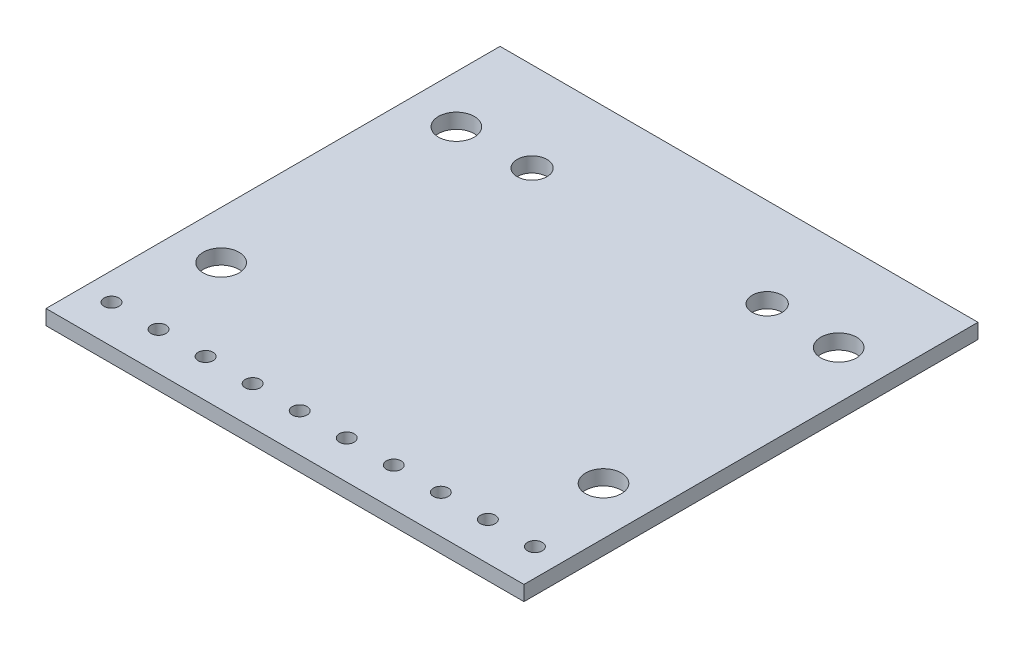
ISO-10303-21;
HEADER;
FILE_DESCRIPTION(('STEP AP214'),'2;1');
FILE_NAME('part.step','',(''),(''),'','','');
FILE_SCHEMA(('AUTOMOTIVE_DESIGN { 1 0 10303 214 1 1 1 1 }'));
ENDSEC;
DATA;
#1=APPLICATION_CONTEXT('core data for automotive mechanical design processes');
#2=APPLICATION_PROTOCOL_DEFINITION('international standard','automotive_design',2000,#1);
#3=PRODUCT_CONTEXT('',#1,'mechanical');
#4=PRODUCT('Part','Part','',(#3));
#5=PRODUCT_RELATED_PRODUCT_CATEGORY('part','',(#4));
#6=PRODUCT_DEFINITION_FORMATION('','',#4);
#7=PRODUCT_DEFINITION_CONTEXT('part definition',#1,'design');
#8=PRODUCT_DEFINITION('design','',#6,#7);
#9=PRODUCT_DEFINITION_SHAPE('','',#8);
#10=(LENGTH_UNIT() NAMED_UNIT(*) SI_UNIT(.MILLI.,.METRE.));
#11=(NAMED_UNIT(*) PLANE_ANGLE_UNIT() SI_UNIT($,.RADIAN.));
#12=(NAMED_UNIT(*) SI_UNIT($,.STERADIAN.) SOLID_ANGLE_UNIT());
#13=UNCERTAINTY_MEASURE_WITH_UNIT(LENGTH_MEASURE(1.E-05),#10,'distance_accuracy_value','');
#14=(GEOMETRIC_REPRESENTATION_CONTEXT(3) GLOBAL_UNCERTAINTY_ASSIGNED_CONTEXT((#13)) GLOBAL_UNIT_ASSIGNED_CONTEXT((#10,
#11,#12)) REPRESENTATION_CONTEXT('',''));
#15=CARTESIAN_POINT('',(0.,0.,0.));
#16=DIRECTION('',(0.,0.,1.));
#17=DIRECTION('',(1.,0.,0.));
#18=AXIS2_PLACEMENT_3D('',#15,#16,#17);
#19=CARTESIAN_POINT('',(0.,-1.5875,0.));
#20=DIRECTION('',(-1.,0.,0.));
#21=DIRECTION('',(0.,0.,1.));
#22=AXIS2_PLACEMENT_3D('',#19,#20,#21);
#23=PLANE('',#22);
#24=DIRECTION('',(0.,0.,1.));
#25=VECTOR('',#24,1.);
#26=CARTESIAN_POINT('',(0.,0.,0.));
#27=LINE('',#26,#25);
#28=CARTESIAN_POINT('',(0.,0.,-48.26));
#29=VERTEX_POINT('',#28);
#30=CARTESIAN_POINT('',(0.,0.,0.));
#31=VERTEX_POINT('',#30);
#32=EDGE_CURVE('E97',#29,#31,#27,.T.);
#33=ORIENTED_EDGE('',*,*,#32,.F.);
#34=DIRECTION('',(0.,1.,0.));
#35=VECTOR('',#34,1.);
#36=CARTESIAN_POINT('',(0.,-1.5875,-48.26));
#37=LINE('',#36,#35);
#38=CARTESIAN_POINT('',(0.,-1.5875,-48.26));
#39=VERTEX_POINT('',#38);
#40=EDGE_CURVE('E11',#39,#29,#37,.T.);
#41=ORIENTED_EDGE('',*,*,#40,.F.);
#42=DIRECTION('',(0.,0.,1.));
#43=VECTOR('',#42,1.);
#44=CARTESIAN_POINT('',(0.,-1.5875,0.));
#45=LINE('',#44,#43);
#46=CARTESIAN_POINT('',(0.,-1.5875,0.));
#47=VERTEX_POINT('',#46);
#48=EDGE_CURVE('E90',#39,#47,#45,.T.);
#49=ORIENTED_EDGE('',*,*,#48,.T.);
#50=DIRECTION('',(0.,1.,0.));
#51=VECTOR('',#50,1.);
#52=CARTESIAN_POINT('',(0.,-1.5875,0.));
#53=LINE('',#52,#51);
#54=EDGE_CURVE('E35',#47,#31,#53,.T.);
#55=ORIENTED_EDGE('',*,*,#54,.T.);
#56=EDGE_LOOP('',(#33,#41,#49,#55));
#57=FACE_BOUND('',#56,.T.);
#58=ADVANCED_FACE('F32',(#57),#23,.T.);
#59=CARTESIAN_POINT('',(0.,-1.5875,-48.26));
#60=DIRECTION('',(0.,0.,-1.));
#61=DIRECTION('',(-1.,0.,0.));
#62=AXIS2_PLACEMENT_3D('',#59,#60,#61);
#63=PLANE('',#62);
#64=DIRECTION('',(-1.,0.,0.));
#65=VECTOR('',#64,1.);
#66=CARTESIAN_POINT('',(0.,0.,-48.26));
#67=LINE('',#66,#65);
#68=CARTESIAN_POINT('',(50.8,0.,-48.26));
#69=VERTEX_POINT('',#68);
#70=EDGE_CURVE('E92',#69,#29,#67,.T.);
#71=ORIENTED_EDGE('',*,*,#70,.F.);
#72=DIRECTION('',(0.,1.,0.));
#73=VECTOR('',#72,1.);
#74=CARTESIAN_POINT('',(50.8,-1.5875,-48.26));
#75=LINE('',#74,#73);
#76=CARTESIAN_POINT('',(50.8,-1.5875,-48.26));
#77=VERTEX_POINT('',#76);
#78=EDGE_CURVE('E41',#77,#69,#75,.T.);
#79=ORIENTED_EDGE('',*,*,#78,.F.);
#80=DIRECTION('',(-1.,0.,0.));
#81=VECTOR('',#80,1.);
#82=CARTESIAN_POINT('',(0.,-1.5875,-48.26));
#83=LINE('',#82,#81);
#84=EDGE_CURVE('E87',#77,#39,#83,.T.);
#85=ORIENTED_EDGE('',*,*,#84,.T.);
#86=ORIENTED_EDGE('',*,*,#40,.T.);
#87=EDGE_LOOP('',(#71,#79,#85,#86));
#88=FACE_BOUND('',#87,.T.);
#89=ADVANCED_FACE('F108',(#88),#63,.T.);
#90=CARTESIAN_POINT('',(50.8,-1.5875,0.));
#91=DIRECTION('',(1.,0.,0.));
#92=DIRECTION('',(0.,0.,-1.));
#93=AXIS2_PLACEMENT_3D('',#90,#91,#92);
#94=PLANE('',#93);
#95=DIRECTION('',(0.,0.,-1.));
#96=VECTOR('',#95,1.);
#97=CARTESIAN_POINT('',(50.8,0.,0.));
#98=LINE('',#97,#96);
#99=CARTESIAN_POINT('',(50.8,0.,0.));
#100=VERTEX_POINT('',#99);
#101=EDGE_CURVE('E82',#100,#69,#98,.T.);
#102=ORIENTED_EDGE('',*,*,#101,.F.);
#103=DIRECTION('',(0.,1.,0.));
#104=VECTOR('',#103,1.);
#105=CARTESIAN_POINT('',(50.8,-1.5875,0.));
#106=LINE('',#105,#104);
#107=CARTESIAN_POINT('',(50.8,-1.5875,0.));
#108=VERTEX_POINT('',#107);
#109=EDGE_CURVE('E77',#108,#100,#106,.T.);
#110=ORIENTED_EDGE('',*,*,#109,.F.);
#111=DIRECTION('',(0.,0.,-1.));
#112=VECTOR('',#111,1.);
#113=CARTESIAN_POINT('',(50.8,-1.5875,0.));
#114=LINE('',#113,#112);
#115=EDGE_CURVE('E80',#108,#77,#114,.T.);
#116=ORIENTED_EDGE('',*,*,#115,.T.);
#117=ORIENTED_EDGE('',*,*,#78,.T.);
#118=EDGE_LOOP('',(#102,#110,#116,#117));
#119=FACE_BOUND('',#118,.T.);
#120=ADVANCED_FACE('F79',(#119),#94,.T.);
#121=CARTESIAN_POINT('',(0.,-1.5875,0.));
#122=DIRECTION('',(0.,0.,1.));
#123=DIRECTION('',(1.,0.,0.));
#124=AXIS2_PLACEMENT_3D('',#121,#122,#123);
#125=PLANE('',#124);
#126=DIRECTION('',(1.,0.,0.));
#127=VECTOR('',#126,1.);
#128=CARTESIAN_POINT('',(0.,0.,0.));
#129=LINE('',#128,#127);
#130=EDGE_CURVE('E100',#31,#100,#129,.T.);
#131=ORIENTED_EDGE('',*,*,#130,.F.);
#132=ORIENTED_EDGE('',*,*,#54,.F.);
#133=DIRECTION('',(1.,0.,0.));
#134=VECTOR('',#133,1.);
#135=CARTESIAN_POINT('',(0.,-1.5875,0.));
#136=LINE('',#135,#134);
#137=EDGE_CURVE('E86',#47,#108,#136,.T.);
#138=ORIENTED_EDGE('',*,*,#137,.T.);
#139=ORIENTED_EDGE('',*,*,#109,.T.);
#140=EDGE_LOOP('',(#131,#132,#138,#139));
#141=FACE_BOUND('',#140,.T.);
#142=ADVANCED_FACE('F89',(#141),#125,.T.);
#143=CARTESIAN_POINT('',(0.,-1.5875,0.));
#144=DIRECTION('',(0.,-1.,0.));
#145=DIRECTION('',(0.,0.,-1.));
#146=AXIS2_PLACEMENT_3D('',#143,#144,#145);
#147=PLANE('',#146);
#148=CARTESIAN_POINT('',(37.895,-1.5875,-38.76));
#149=DIRECTION('',(0.,1.,0.));
#150=DIRECTION('',(0.,0.,-1.));
#151=AXIS2_PLACEMENT_3D('',#148,#149,#150);
#152=CIRCLE('',#151,1.59);
#153=CARTESIAN_POINT('',(37.895,-1.5875,-40.35));
#154=VERTEX_POINT('',#153);
#155=EDGE_CURVE('E197',#154,#154,#152,.T.);
#156=ORIENTED_EDGE('',*,*,#155,.T.);
#157=EDGE_LOOP('',(#156));
#158=FACE_BOUND('',#157,.T.);
#159=CARTESIAN_POINT('',(12.905,-1.5875,-38.76));
#160=DIRECTION('',(0.,1.,0.));
#161=DIRECTION('',(0.,0.,1.));
#162=AXIS2_PLACEMENT_3D('',#159,#160,#161);
#163=CIRCLE('',#162,1.59);
#164=CARTESIAN_POINT('',(12.905,-1.5875,-37.17));
#165=VERTEX_POINT('',#164);
#166=EDGE_CURVE('E205',#165,#165,#163,.T.);
#167=ORIENTED_EDGE('',*,*,#166,.T.);
#168=EDGE_LOOP('',(#167));
#169=FACE_BOUND('',#168,.T.);
#170=CARTESIAN_POINT('',(47.9,-1.5875,-4.064));
#171=DIRECTION('',(0.,1.,0.));
#172=DIRECTION('',(0.,0.,1.));
#173=AXIS2_PLACEMENT_3D('',#170,#171,#172);
#174=CIRCLE('',#173,0.787400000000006);
#175=CARTESIAN_POINT('',(47.9,-1.5875,-3.27659999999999));
#176=VERTEX_POINT('',#175);
#177=EDGE_CURVE('E211',#176,#176,#174,.T.);
#178=ORIENTED_EDGE('',*,*,#177,.T.);
#179=EDGE_LOOP('',(#178));
#180=FACE_BOUND('',#179,.T.);
#181=CARTESIAN_POINT('',(37.9,-1.5875,-4.064));
#182=DIRECTION('',(0.,1.,0.));
#183=DIRECTION('',(0.,0.,1.));
#184=AXIS2_PLACEMENT_3D('',#181,#182,#183);
#185=CIRCLE('',#184,0.787399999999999);
#186=CARTESIAN_POINT('',(37.9,-1.5875,-3.2766));
#187=VERTEX_POINT('',#186);
#188=EDGE_CURVE('E217',#187,#187,#185,.T.);
#189=ORIENTED_EDGE('',*,*,#188,.T.);
#190=EDGE_LOOP('',(#189));
#191=FACE_BOUND('',#190,.T.);
#192=CARTESIAN_POINT('',(32.9,-1.5875,-4.064));
#193=DIRECTION('',(0.,1.,0.));
#194=DIRECTION('',(0.,0.,1.));
#195=AXIS2_PLACEMENT_3D('',#192,#193,#194);
#196=CIRCLE('',#195,0.787399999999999);
#197=CARTESIAN_POINT('',(32.9,-1.5875,-3.2766));
#198=VERTEX_POINT('',#197);
#199=EDGE_CURVE('E223',#198,#198,#196,.T.);
#200=ORIENTED_EDGE('',*,*,#199,.T.);
#201=EDGE_LOOP('',(#200));
#202=FACE_BOUND('',#201,.T.);
#203=CARTESIAN_POINT('',(27.9,-1.5875,-4.064));
#204=DIRECTION('',(0.,1.,0.));
#205=DIRECTION('',(0.,0.,1.));
#206=AXIS2_PLACEMENT_3D('',#203,#204,#205);
#207=CIRCLE('',#206,0.787400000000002);
#208=CARTESIAN_POINT('',(27.9,-1.5875,-3.2766));
#209=VERTEX_POINT('',#208);
#210=EDGE_CURVE('E229',#209,#209,#207,.T.);
#211=ORIENTED_EDGE('',*,*,#210,.T.);
#212=EDGE_LOOP('',(#211));
#213=FACE_BOUND('',#212,.T.);
#214=CARTESIAN_POINT('',(22.9,-1.5875,-4.064));
#215=DIRECTION('',(0.,1.,0.));
#216=DIRECTION('',(0.,0.,1.));
#217=AXIS2_PLACEMENT_3D('',#214,#215,#216);
#218=CIRCLE('',#217,0.787400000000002);
#219=CARTESIAN_POINT('',(22.9,-1.5875,-3.2766));
#220=VERTEX_POINT('',#219);
#221=EDGE_CURVE('E235',#220,#220,#218,.T.);
#222=ORIENTED_EDGE('',*,*,#221,.T.);
#223=EDGE_LOOP('',(#222));
#224=FACE_BOUND('',#223,.T.);
#225=CARTESIAN_POINT('',(17.9,-1.5875,-4.064));
#226=DIRECTION('',(0.,1.,0.));
#227=DIRECTION('',(0.,0.,1.));
#228=AXIS2_PLACEMENT_3D('',#225,#226,#227);
#229=CIRCLE('',#228,0.787400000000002);
#230=CARTESIAN_POINT('',(17.9,-1.5875,-3.2766));
#231=VERTEX_POINT('',#230);
#232=EDGE_CURVE('E241',#231,#231,#229,.T.);
#233=ORIENTED_EDGE('',*,*,#232,.T.);
#234=EDGE_LOOP('',(#233));
#235=FACE_BOUND('',#234,.T.);
#236=CARTESIAN_POINT('',(12.9,-1.5875,-4.064));
#237=DIRECTION('',(0.,1.,0.));
#238=DIRECTION('',(0.,0.,1.));
#239=AXIS2_PLACEMENT_3D('',#236,#237,#238);
#240=CIRCLE('',#239,0.787400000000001);
#241=CARTESIAN_POINT('',(12.9,-1.5875,-3.2766));
#242=VERTEX_POINT('',#241);
#243=EDGE_CURVE('E247',#242,#242,#240,.T.);
#244=ORIENTED_EDGE('',*,*,#243,.T.);
#245=EDGE_LOOP('',(#244));
#246=FACE_BOUND('',#245,.T.);
#247=CARTESIAN_POINT('',(7.9,-1.5875,-4.064));
#248=DIRECTION('',(0.,1.,0.));
#249=DIRECTION('',(0.,0.,1.));
#250=AXIS2_PLACEMENT_3D('',#247,#248,#249);
#251=CIRCLE('',#250,0.787400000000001);
#252=CARTESIAN_POINT('',(7.9,-1.5875,-3.2766));
#253=VERTEX_POINT('',#252);
#254=EDGE_CURVE('E253',#253,#253,#251,.T.);
#255=ORIENTED_EDGE('',*,*,#254,.T.);
#256=EDGE_LOOP('',(#255));
#257=FACE_BOUND('',#256,.T.);
#258=CARTESIAN_POINT('',(42.9,-1.5875,-4.064));
#259=DIRECTION('',(0.,1.,0.));
#260=DIRECTION('',(0.,0.,1.));
#261=AXIS2_PLACEMENT_3D('',#258,#259,#260);
#262=CIRCLE('',#261,0.787399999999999);
#263=CARTESIAN_POINT('',(42.9,-1.5875,-3.2766));
#264=VERTEX_POINT('',#263);
#265=EDGE_CURVE('E259',#264,#264,#262,.T.);
#266=ORIENTED_EDGE('',*,*,#265,.T.);
#267=EDGE_LOOP('',(#266));
#268=FACE_BOUND('',#267,.T.);
#269=CARTESIAN_POINT('',(2.9,-1.5875,-4.064));
#270=DIRECTION('',(0.,1.,0.));
#271=DIRECTION('',(0.,0.,1.));
#272=AXIS2_PLACEMENT_3D('',#269,#270,#271);
#273=CIRCLE('',#272,0.7874);
#274=CARTESIAN_POINT('',(2.9,-1.5875,-3.2766));
#275=VERTEX_POINT('',#274);
#276=EDGE_CURVE('E265',#275,#275,#273,.T.);
#277=ORIENTED_EDGE('',*,*,#276,.T.);
#278=EDGE_LOOP('',(#277));
#279=FACE_BOUND('',#278,.T.);
#280=CARTESIAN_POINT('',(45.72,-1.5875,-38.535));
#281=DIRECTION('',(0.,1.,0.));
#282=DIRECTION('',(0.,0.,-1.));
#283=AXIS2_PLACEMENT_3D('',#280,#281,#282);
#284=CIRCLE('',#283,1.905);
#285=CARTESIAN_POINT('',(45.72,-1.5875,-40.44));
#286=VERTEX_POINT('',#285);
#287=EDGE_CURVE('E271',#286,#286,#284,.T.);
#288=ORIENTED_EDGE('',*,*,#287,.T.);
#289=EDGE_LOOP('',(#288));
#290=FACE_BOUND('',#289,.T.);
#291=CARTESIAN_POINT('',(45.72,-1.5875,-13.535));
#292=DIRECTION('',(0.,1.,0.));
#293=DIRECTION('',(0.,0.,-1.));
#294=AXIS2_PLACEMENT_3D('',#291,#292,#293);
#295=CIRCLE('',#294,1.90499999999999);
#296=CARTESIAN_POINT('',(45.72,-1.5875,-15.44));
#297=VERTEX_POINT('',#296);
#298=EDGE_CURVE('E277',#297,#297,#295,.T.);
#299=ORIENTED_EDGE('',*,*,#298,.T.);
#300=EDGE_LOOP('',(#299));
#301=FACE_BOUND('',#300,.T.);
#302=CARTESIAN_POINT('',(5.08,-1.5875,-38.535));
#303=DIRECTION('',(0.,1.,0.));
#304=DIRECTION('',(0.,0.,1.));
#305=AXIS2_PLACEMENT_3D('',#302,#303,#304);
#306=CIRCLE('',#305,1.905);
#307=CARTESIAN_POINT('',(5.08,-1.5875,-36.63));
#308=VERTEX_POINT('',#307);
#309=EDGE_CURVE('E283',#308,#308,#306,.T.);
#310=ORIENTED_EDGE('',*,*,#309,.T.);
#311=EDGE_LOOP('',(#310));
#312=FACE_BOUND('',#311,.T.);
#313=CARTESIAN_POINT('',(5.08,-1.5875,-13.535));
#314=DIRECTION('',(0.,1.,0.));
#315=DIRECTION('',(0.,0.,1.));
#316=AXIS2_PLACEMENT_3D('',#313,#314,#315);
#317=CIRCLE('',#316,1.905);
#318=CARTESIAN_POINT('',(5.08,-1.5875,-11.63));
#319=VERTEX_POINT('',#318);
#320=EDGE_CURVE('E101',#319,#319,#317,.T.);
#321=ORIENTED_EDGE('',*,*,#320,.T.);
#322=EDGE_LOOP('',(#321));
#323=FACE_BOUND('',#322,.T.);
#324=ORIENTED_EDGE('',*,*,#48,.F.);
#325=ORIENTED_EDGE('',*,*,#84,.F.);
#326=ORIENTED_EDGE('',*,*,#115,.F.);
#327=ORIENTED_EDGE('',*,*,#137,.F.);
#328=EDGE_LOOP('',(#324,#325,#326,#327));
#329=FACE_BOUND('',#328,.T.);
#330=ADVANCED_FACE('F85',(#158,#169,#180,#191,#202,#213,#224,#235,#246,#257,#268,#279,#290,#301,
#312,#323,#329),#147,.T.);
#331=CARTESIAN_POINT('',(0.,0.,0.));
#332=DIRECTION('',(0.,-1.,0.));
#333=DIRECTION('',(0.,0.,-1.));
#334=AXIS2_PLACEMENT_3D('',#331,#332,#333);
#335=PLANE('',#334);
#336=CARTESIAN_POINT('',(37.895,0.,-38.76));
#337=DIRECTION('',(0.,1.,0.));
#338=DIRECTION('',(0.,0.,-1.));
#339=AXIS2_PLACEMENT_3D('',#336,#337,#338);
#340=CIRCLE('',#339,1.59);
#341=CARTESIAN_POINT('',(37.895,0.,-40.35));
#342=VERTEX_POINT('',#341);
#343=EDGE_CURVE('E200',#342,#342,#340,.T.);
#344=ORIENTED_EDGE('',*,*,#343,.F.);
#345=EDGE_LOOP('',(#344));
#346=FACE_BOUND('',#345,.T.);
#347=CARTESIAN_POINT('',(12.905,0.,-38.76));
#348=DIRECTION('',(0.,1.,0.));
#349=DIRECTION('',(0.,0.,1.));
#350=AXIS2_PLACEMENT_3D('',#347,#348,#349);
#351=CIRCLE('',#350,1.59);
#352=CARTESIAN_POINT('',(12.905,0.,-37.17));
#353=VERTEX_POINT('',#352);
#354=EDGE_CURVE('E202',#353,#353,#351,.T.);
#355=ORIENTED_EDGE('',*,*,#354,.F.);
#356=EDGE_LOOP('',(#355));
#357=FACE_BOUND('',#356,.T.);
#358=CARTESIAN_POINT('',(47.9,0.,-4.064));
#359=DIRECTION('',(0.,1.,0.));
#360=DIRECTION('',(0.,0.,1.));
#361=AXIS2_PLACEMENT_3D('',#358,#359,#360);
#362=CIRCLE('',#361,0.787400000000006);
#363=CARTESIAN_POINT('',(47.9,0.,-3.27659999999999));
#364=VERTEX_POINT('',#363);
#365=EDGE_CURVE('E208',#364,#364,#362,.T.);
#366=ORIENTED_EDGE('',*,*,#365,.F.);
#367=EDGE_LOOP('',(#366));
#368=FACE_BOUND('',#367,.T.);
#369=CARTESIAN_POINT('',(37.9,0.,-4.064));
#370=DIRECTION('',(0.,1.,0.));
#371=DIRECTION('',(0.,0.,1.));
#372=AXIS2_PLACEMENT_3D('',#369,#370,#371);
#373=CIRCLE('',#372,0.787399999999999);
#374=CARTESIAN_POINT('',(37.9,0.,-3.2766));
#375=VERTEX_POINT('',#374);
#376=EDGE_CURVE('E214',#375,#375,#373,.T.);
#377=ORIENTED_EDGE('',*,*,#376,.F.);
#378=EDGE_LOOP('',(#377));
#379=FACE_BOUND('',#378,.T.);
#380=CARTESIAN_POINT('',(32.9,0.,-4.064));
#381=DIRECTION('',(0.,1.,0.));
#382=DIRECTION('',(0.,0.,1.));
#383=AXIS2_PLACEMENT_3D('',#380,#381,#382);
#384=CIRCLE('',#383,0.787399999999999);
#385=CARTESIAN_POINT('',(32.9,0.,-3.2766));
#386=VERTEX_POINT('',#385);
#387=EDGE_CURVE('E220',#386,#386,#384,.T.);
#388=ORIENTED_EDGE('',*,*,#387,.F.);
#389=EDGE_LOOP('',(#388));
#390=FACE_BOUND('',#389,.T.);
#391=CARTESIAN_POINT('',(27.9,0.,-4.064));
#392=DIRECTION('',(0.,1.,0.));
#393=DIRECTION('',(0.,0.,1.));
#394=AXIS2_PLACEMENT_3D('',#391,#392,#393);
#395=CIRCLE('',#394,0.787400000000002);
#396=CARTESIAN_POINT('',(27.9,0.,-3.2766));
#397=VERTEX_POINT('',#396);
#398=EDGE_CURVE('E226',#397,#397,#395,.T.);
#399=ORIENTED_EDGE('',*,*,#398,.F.);
#400=EDGE_LOOP('',(#399));
#401=FACE_BOUND('',#400,.T.);
#402=CARTESIAN_POINT('',(22.9,0.,-4.064));
#403=DIRECTION('',(0.,1.,0.));
#404=DIRECTION('',(0.,0.,1.));
#405=AXIS2_PLACEMENT_3D('',#402,#403,#404);
#406=CIRCLE('',#405,0.787400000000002);
#407=CARTESIAN_POINT('',(22.9,0.,-3.2766));
#408=VERTEX_POINT('',#407);
#409=EDGE_CURVE('E232',#408,#408,#406,.T.);
#410=ORIENTED_EDGE('',*,*,#409,.F.);
#411=EDGE_LOOP('',(#410));
#412=FACE_BOUND('',#411,.T.);
#413=CARTESIAN_POINT('',(17.9,0.,-4.064));
#414=DIRECTION('',(0.,1.,0.));
#415=DIRECTION('',(0.,0.,1.));
#416=AXIS2_PLACEMENT_3D('',#413,#414,#415);
#417=CIRCLE('',#416,0.787400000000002);
#418=CARTESIAN_POINT('',(17.9,0.,-3.2766));
#419=VERTEX_POINT('',#418);
#420=EDGE_CURVE('E238',#419,#419,#417,.T.);
#421=ORIENTED_EDGE('',*,*,#420,.F.);
#422=EDGE_LOOP('',(#421));
#423=FACE_BOUND('',#422,.T.);
#424=CARTESIAN_POINT('',(12.9,0.,-4.064));
#425=DIRECTION('',(0.,1.,0.));
#426=DIRECTION('',(0.,0.,1.));
#427=AXIS2_PLACEMENT_3D('',#424,#425,#426);
#428=CIRCLE('',#427,0.787400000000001);
#429=CARTESIAN_POINT('',(12.9,0.,-3.2766));
#430=VERTEX_POINT('',#429);
#431=EDGE_CURVE('E244',#430,#430,#428,.T.);
#432=ORIENTED_EDGE('',*,*,#431,.F.);
#433=EDGE_LOOP('',(#432));
#434=FACE_BOUND('',#433,.T.);
#435=CARTESIAN_POINT('',(7.9,0.,-4.064));
#436=DIRECTION('',(0.,1.,0.));
#437=DIRECTION('',(0.,0.,1.));
#438=AXIS2_PLACEMENT_3D('',#435,#436,#437);
#439=CIRCLE('',#438,0.787400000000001);
#440=CARTESIAN_POINT('',(7.9,0.,-3.2766));
#441=VERTEX_POINT('',#440);
#442=EDGE_CURVE('E250',#441,#441,#439,.T.);
#443=ORIENTED_EDGE('',*,*,#442,.F.);
#444=EDGE_LOOP('',(#443));
#445=FACE_BOUND('',#444,.T.);
#446=CARTESIAN_POINT('',(42.9,0.,-4.064));
#447=DIRECTION('',(0.,1.,0.));
#448=DIRECTION('',(0.,0.,1.));
#449=AXIS2_PLACEMENT_3D('',#446,#447,#448);
#450=CIRCLE('',#449,0.787399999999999);
#451=CARTESIAN_POINT('',(42.9,0.,-3.2766));
#452=VERTEX_POINT('',#451);
#453=EDGE_CURVE('E256',#452,#452,#450,.T.);
#454=ORIENTED_EDGE('',*,*,#453,.F.);
#455=EDGE_LOOP('',(#454));
#456=FACE_BOUND('',#455,.T.);
#457=CARTESIAN_POINT('',(2.9,0.,-4.064));
#458=DIRECTION('',(0.,1.,0.));
#459=DIRECTION('',(0.,0.,1.));
#460=AXIS2_PLACEMENT_3D('',#457,#458,#459);
#461=CIRCLE('',#460,0.7874);
#462=CARTESIAN_POINT('',(2.9,0.,-3.2766));
#463=VERTEX_POINT('',#462);
#464=EDGE_CURVE('E262',#463,#463,#461,.T.);
#465=ORIENTED_EDGE('',*,*,#464,.F.);
#466=EDGE_LOOP('',(#465));
#467=FACE_BOUND('',#466,.T.);
#468=CARTESIAN_POINT('',(45.72,0.,-38.535));
#469=DIRECTION('',(0.,1.,0.));
#470=DIRECTION('',(0.,0.,-1.));
#471=AXIS2_PLACEMENT_3D('',#468,#469,#470);
#472=CIRCLE('',#471,1.905);
#473=CARTESIAN_POINT('',(45.72,0.,-40.44));
#474=VERTEX_POINT('',#473);
#475=EDGE_CURVE('E268',#474,#474,#472,.T.);
#476=ORIENTED_EDGE('',*,*,#475,.F.);
#477=EDGE_LOOP('',(#476));
#478=FACE_BOUND('',#477,.T.);
#479=CARTESIAN_POINT('',(45.72,0.,-13.535));
#480=DIRECTION('',(0.,1.,0.));
#481=DIRECTION('',(0.,0.,-1.));
#482=AXIS2_PLACEMENT_3D('',#479,#480,#481);
#483=CIRCLE('',#482,1.90499999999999);
#484=CARTESIAN_POINT('',(45.72,0.,-15.44));
#485=VERTEX_POINT('',#484);
#486=EDGE_CURVE('E274',#485,#485,#483,.T.);
#487=ORIENTED_EDGE('',*,*,#486,.F.);
#488=EDGE_LOOP('',(#487));
#489=FACE_BOUND('',#488,.T.);
#490=CARTESIAN_POINT('',(5.08,0.,-38.535));
#491=DIRECTION('',(0.,1.,0.));
#492=DIRECTION('',(0.,0.,1.));
#493=AXIS2_PLACEMENT_3D('',#490,#491,#492);
#494=CIRCLE('',#493,1.905);
#495=CARTESIAN_POINT('',(5.08,0.,-36.63));
#496=VERTEX_POINT('',#495);
#497=EDGE_CURVE('E280',#496,#496,#494,.T.);
#498=ORIENTED_EDGE('',*,*,#497,.F.);
#499=EDGE_LOOP('',(#498));
#500=FACE_BOUND('',#499,.T.);
#501=CARTESIAN_POINT('',(5.08,0.,-13.535));
#502=DIRECTION('',(0.,1.,0.));
#503=DIRECTION('',(0.,0.,1.));
#504=AXIS2_PLACEMENT_3D('',#501,#502,#503);
#505=CIRCLE('',#504,1.905);
#506=CARTESIAN_POINT('',(5.08,0.,-11.63));
#507=VERTEX_POINT('',#506);
#508=EDGE_CURVE('E286',#507,#507,#505,.T.);
#509=ORIENTED_EDGE('',*,*,#508,.F.);
#510=EDGE_LOOP('',(#509));
#511=FACE_BOUND('',#510,.T.);
#512=ORIENTED_EDGE('',*,*,#32,.T.);
#513=ORIENTED_EDGE('',*,*,#130,.T.);
#514=ORIENTED_EDGE('',*,*,#101,.T.);
#515=ORIENTED_EDGE('',*,*,#70,.T.);
#516=EDGE_LOOP('',(#512,#513,#514,#515));
#517=FACE_BOUND('',#516,.T.);
#518=ADVANCED_FACE('F107',(#346,#357,#368,#379,#390,#401,#412,#423,#434,#445,#456,#467,#478,
#489,#500,#511,#517),#335,.F.);
#519=CARTESIAN_POINT('',(5.08,-1.5875,-13.535));
#520=DIRECTION('',(0.,1.,0.));
#521=DIRECTION('',(0.,0.,1.));
#522=AXIS2_PLACEMENT_3D('',#519,#520,#521);
#523=CYLINDRICAL_SURFACE('',#522,1.905);
#524=ORIENTED_EDGE('',*,*,#320,.F.);
#525=EDGE_LOOP('',(#524));
#526=FACE_BOUND('',#525,.T.);
#527=ORIENTED_EDGE('',*,*,#508,.T.);
#528=EDGE_LOOP('',(#527));
#529=FACE_BOUND('',#528,.T.);
#530=ADVANCED_FACE('F126',(#526,#529),#523,.F.);
#531=CARTESIAN_POINT('',(5.08,-1.5875,-38.535));
#532=DIRECTION('',(0.,1.,0.));
#533=DIRECTION('',(0.,0.,1.));
#534=AXIS2_PLACEMENT_3D('',#531,#532,#533);
#535=CYLINDRICAL_SURFACE('',#534,1.905);
#536=ORIENTED_EDGE('',*,*,#309,.F.);
#537=EDGE_LOOP('',(#536));
#538=FACE_BOUND('',#537,.T.);
#539=ORIENTED_EDGE('',*,*,#497,.T.);
#540=EDGE_LOOP('',(#539));
#541=FACE_BOUND('',#540,.T.);
#542=ADVANCED_FACE('F133',(#538,#541),#535,.F.);
#543=CARTESIAN_POINT('',(45.72,-1.5875,-13.535));
#544=DIRECTION('',(0.,1.,0.));
#545=DIRECTION('',(0.,0.,1.));
#546=AXIS2_PLACEMENT_3D('',#543,#544,#545);
#547=CYLINDRICAL_SURFACE('',#546,1.90499999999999);
#548=ORIENTED_EDGE('',*,*,#298,.F.);
#549=EDGE_LOOP('',(#548));
#550=FACE_BOUND('',#549,.T.);
#551=ORIENTED_EDGE('',*,*,#486,.T.);
#552=EDGE_LOOP('',(#551));
#553=FACE_BOUND('',#552,.T.);
#554=ADVANCED_FACE('F137',(#550,#553),#547,.F.);
#555=CARTESIAN_POINT('',(45.72,-1.5875,-38.535));
#556=DIRECTION('',(0.,1.,0.));
#557=DIRECTION('',(0.,0.,1.));
#558=AXIS2_PLACEMENT_3D('',#555,#556,#557);
#559=CYLINDRICAL_SURFACE('',#558,1.905);
#560=ORIENTED_EDGE('',*,*,#287,.F.);
#561=EDGE_LOOP('',(#560));
#562=FACE_BOUND('',#561,.T.);
#563=ORIENTED_EDGE('',*,*,#475,.T.);
#564=EDGE_LOOP('',(#563));
#565=FACE_BOUND('',#564,.T.);
#566=ADVANCED_FACE('F141',(#562,#565),#559,.F.);
#567=CARTESIAN_POINT('',(2.9,-1.5875,-4.064));
#568=DIRECTION('',(0.,1.,0.));
#569=DIRECTION('',(0.,0.,1.));
#570=AXIS2_PLACEMENT_3D('',#567,#568,#569);
#571=CYLINDRICAL_SURFACE('',#570,0.7874);
#572=ORIENTED_EDGE('',*,*,#276,.F.);
#573=EDGE_LOOP('',(#572));
#574=FACE_BOUND('',#573,.T.);
#575=ORIENTED_EDGE('',*,*,#464,.T.);
#576=EDGE_LOOP('',(#575));
#577=FACE_BOUND('',#576,.T.);
#578=ADVANCED_FACE('F145',(#574,#577),#571,.F.);
#579=CARTESIAN_POINT('',(42.9,-1.5875,-4.064));
#580=DIRECTION('',(0.,1.,0.));
#581=DIRECTION('',(0.,0.,1.));
#582=AXIS2_PLACEMENT_3D('',#579,#580,#581);
#583=CYLINDRICAL_SURFACE('',#582,0.787399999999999);
#584=ORIENTED_EDGE('',*,*,#265,.F.);
#585=EDGE_LOOP('',(#584));
#586=FACE_BOUND('',#585,.T.);
#587=ORIENTED_EDGE('',*,*,#453,.T.);
#588=EDGE_LOOP('',(#587));
#589=FACE_BOUND('',#588,.T.);
#590=ADVANCED_FACE('F149',(#586,#589),#583,.F.);
#591=CARTESIAN_POINT('',(7.9,-1.5875,-4.064));
#592=DIRECTION('',(0.,1.,0.));
#593=DIRECTION('',(0.,0.,1.));
#594=AXIS2_PLACEMENT_3D('',#591,#592,#593);
#595=CYLINDRICAL_SURFACE('',#594,0.787400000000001);
#596=ORIENTED_EDGE('',*,*,#254,.F.);
#597=EDGE_LOOP('',(#596));
#598=FACE_BOUND('',#597,.T.);
#599=ORIENTED_EDGE('',*,*,#442,.T.);
#600=EDGE_LOOP('',(#599));
#601=FACE_BOUND('',#600,.T.);
#602=ADVANCED_FACE('F153',(#598,#601),#595,.F.);
#603=CARTESIAN_POINT('',(12.9,-1.5875,-4.064));
#604=DIRECTION('',(0.,1.,0.));
#605=DIRECTION('',(0.,0.,1.));
#606=AXIS2_PLACEMENT_3D('',#603,#604,#605);
#607=CYLINDRICAL_SURFACE('',#606,0.787400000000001);
#608=ORIENTED_EDGE('',*,*,#243,.F.);
#609=EDGE_LOOP('',(#608));
#610=FACE_BOUND('',#609,.T.);
#611=ORIENTED_EDGE('',*,*,#431,.T.);
#612=EDGE_LOOP('',(#611));
#613=FACE_BOUND('',#612,.T.);
#614=ADVANCED_FACE('F157',(#610,#613),#607,.F.);
#615=CARTESIAN_POINT('',(17.9,-1.5875,-4.064));
#616=DIRECTION('',(0.,1.,0.));
#617=DIRECTION('',(0.,0.,1.));
#618=AXIS2_PLACEMENT_3D('',#615,#616,#617);
#619=CYLINDRICAL_SURFACE('',#618,0.787400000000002);
#620=ORIENTED_EDGE('',*,*,#232,.F.);
#621=EDGE_LOOP('',(#620));
#622=FACE_BOUND('',#621,.T.);
#623=ORIENTED_EDGE('',*,*,#420,.T.);
#624=EDGE_LOOP('',(#623));
#625=FACE_BOUND('',#624,.T.);
#626=ADVANCED_FACE('F161',(#622,#625),#619,.F.);
#627=CARTESIAN_POINT('',(22.9,-1.5875,-4.064));
#628=DIRECTION('',(0.,1.,0.));
#629=DIRECTION('',(0.,0.,1.));
#630=AXIS2_PLACEMENT_3D('',#627,#628,#629);
#631=CYLINDRICAL_SURFACE('',#630,0.787400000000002);
#632=ORIENTED_EDGE('',*,*,#221,.F.);
#633=EDGE_LOOP('',(#632));
#634=FACE_BOUND('',#633,.T.);
#635=ORIENTED_EDGE('',*,*,#409,.T.);
#636=EDGE_LOOP('',(#635));
#637=FACE_BOUND('',#636,.T.);
#638=ADVANCED_FACE('F165',(#634,#637),#631,.F.);
#639=CARTESIAN_POINT('',(27.9,-1.5875,-4.064));
#640=DIRECTION('',(0.,1.,0.));
#641=DIRECTION('',(0.,0.,1.));
#642=AXIS2_PLACEMENT_3D('',#639,#640,#641);
#643=CYLINDRICAL_SURFACE('',#642,0.787400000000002);
#644=ORIENTED_EDGE('',*,*,#210,.F.);
#645=EDGE_LOOP('',(#644));
#646=FACE_BOUND('',#645,.T.);
#647=ORIENTED_EDGE('',*,*,#398,.T.);
#648=EDGE_LOOP('',(#647));
#649=FACE_BOUND('',#648,.T.);
#650=ADVANCED_FACE('F169',(#646,#649),#643,.F.);
#651=CARTESIAN_POINT('',(32.9,-1.5875,-4.064));
#652=DIRECTION('',(0.,1.,0.));
#653=DIRECTION('',(0.,0.,1.));
#654=AXIS2_PLACEMENT_3D('',#651,#652,#653);
#655=CYLINDRICAL_SURFACE('',#654,0.787399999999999);
#656=ORIENTED_EDGE('',*,*,#199,.F.);
#657=EDGE_LOOP('',(#656));
#658=FACE_BOUND('',#657,.T.);
#659=ORIENTED_EDGE('',*,*,#387,.T.);
#660=EDGE_LOOP('',(#659));
#661=FACE_BOUND('',#660,.T.);
#662=ADVANCED_FACE('F173',(#658,#661),#655,.F.);
#663=CARTESIAN_POINT('',(37.9,-1.5875,-4.064));
#664=DIRECTION('',(0.,1.,0.));
#665=DIRECTION('',(0.,0.,1.));
#666=AXIS2_PLACEMENT_3D('',#663,#664,#665);
#667=CYLINDRICAL_SURFACE('',#666,0.787399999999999);
#668=ORIENTED_EDGE('',*,*,#188,.F.);
#669=EDGE_LOOP('',(#668));
#670=FACE_BOUND('',#669,.T.);
#671=ORIENTED_EDGE('',*,*,#376,.T.);
#672=EDGE_LOOP('',(#671));
#673=FACE_BOUND('',#672,.T.);
#674=ADVANCED_FACE('F177',(#670,#673),#667,.F.);
#675=CARTESIAN_POINT('',(47.9,-1.5875,-4.064));
#676=DIRECTION('',(0.,1.,0.));
#677=DIRECTION('',(0.,0.,1.));
#678=AXIS2_PLACEMENT_3D('',#675,#676,#677);
#679=CYLINDRICAL_SURFACE('',#678,0.787400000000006);
#680=ORIENTED_EDGE('',*,*,#177,.F.);
#681=EDGE_LOOP('',(#680));
#682=FACE_BOUND('',#681,.T.);
#683=ORIENTED_EDGE('',*,*,#365,.T.);
#684=EDGE_LOOP('',(#683));
#685=FACE_BOUND('',#684,.T.);
#686=ADVANCED_FACE('F181',(#682,#685),#679,.F.);
#687=CARTESIAN_POINT('',(12.905,-1.5875,-38.76));
#688=DIRECTION('',(0.,1.,0.));
#689=DIRECTION('',(0.,0.,1.));
#690=AXIS2_PLACEMENT_3D('',#687,#688,#689);
#691=CYLINDRICAL_SURFACE('',#690,1.59);
#692=ORIENTED_EDGE('',*,*,#166,.F.);
#693=EDGE_LOOP('',(#692));
#694=FACE_BOUND('',#693,.T.);
#695=ORIENTED_EDGE('',*,*,#354,.T.);
#696=EDGE_LOOP('',(#695));
#697=FACE_BOUND('',#696,.T.);
#698=ADVANCED_FACE('F185',(#694,#697),#691,.F.);
#699=CARTESIAN_POINT('',(37.895,-1.5875,-38.76));
#700=DIRECTION('',(0.,1.,0.));
#701=DIRECTION('',(0.,0.,1.));
#702=AXIS2_PLACEMENT_3D('',#699,#700,#701);
#703=CYLINDRICAL_SURFACE('',#702,1.59);
#704=ORIENTED_EDGE('',*,*,#155,.F.);
#705=EDGE_LOOP('',(#704));
#706=FACE_BOUND('',#705,.T.);
#707=ORIENTED_EDGE('',*,*,#343,.T.);
#708=EDGE_LOOP('',(#707));
#709=FACE_BOUND('',#708,.T.);
#710=ADVANCED_FACE('F189',(#706,#709),#703,.F.);
#711=CLOSED_SHELL('',(#58,#89,#120,#142,#330,#518,#530,#542,#554,#566,#578,#590,#602,#614,#626,
#638,#650,#662,#674,#686,#698,#710));
#712=MANIFOLD_SOLID_BREP('B2',#711);
#713=ADVANCED_BREP_SHAPE_REPRESENTATION('',(#18,#712),#14);
#714=SHAPE_DEFINITION_REPRESENTATION(#9,#713);
ENDSEC;
END-ISO-10303-21;
